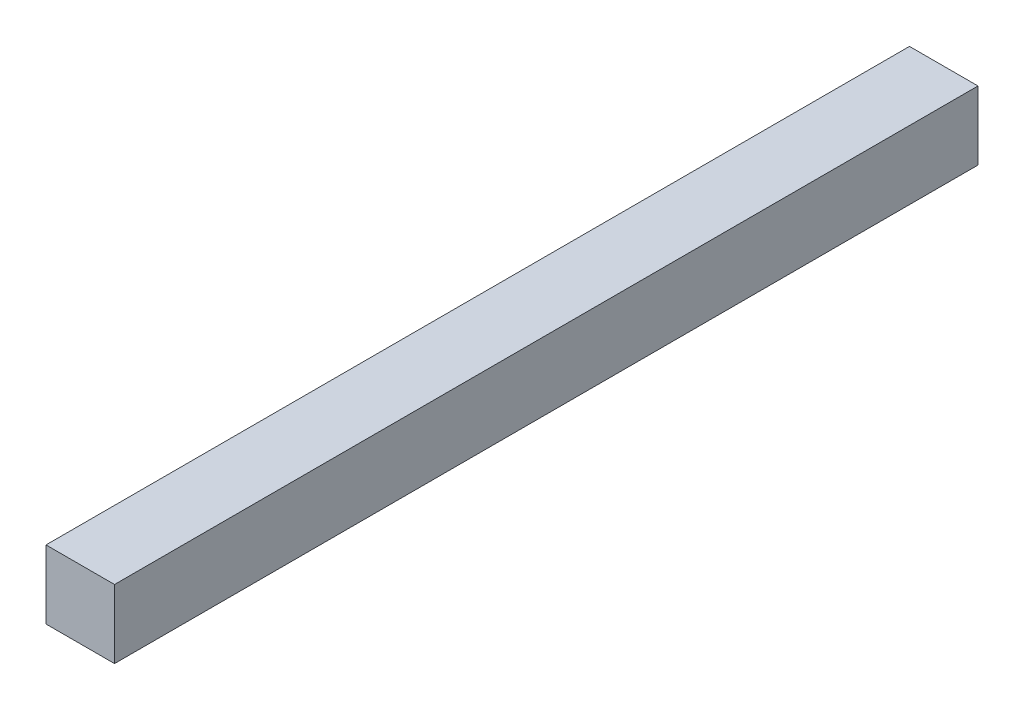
from build123d import *

# Parameters (mm, degrees)
SKETCH1_W      = 6.35
SKETCH1_H      = 6.35
EXTRUDE1_DEPTH = 80.01


with BuildPart() as part:
    # Sketch1 → Extrude1 (new body)
    with BuildSketch(Plane.XY):
        with Locations((3.175, -3.175)):
            Rectangle(SKETCH1_W, SKETCH1_H)
    extrude(amount=EXTRUDE1_DEPTH)


solid = part.part
